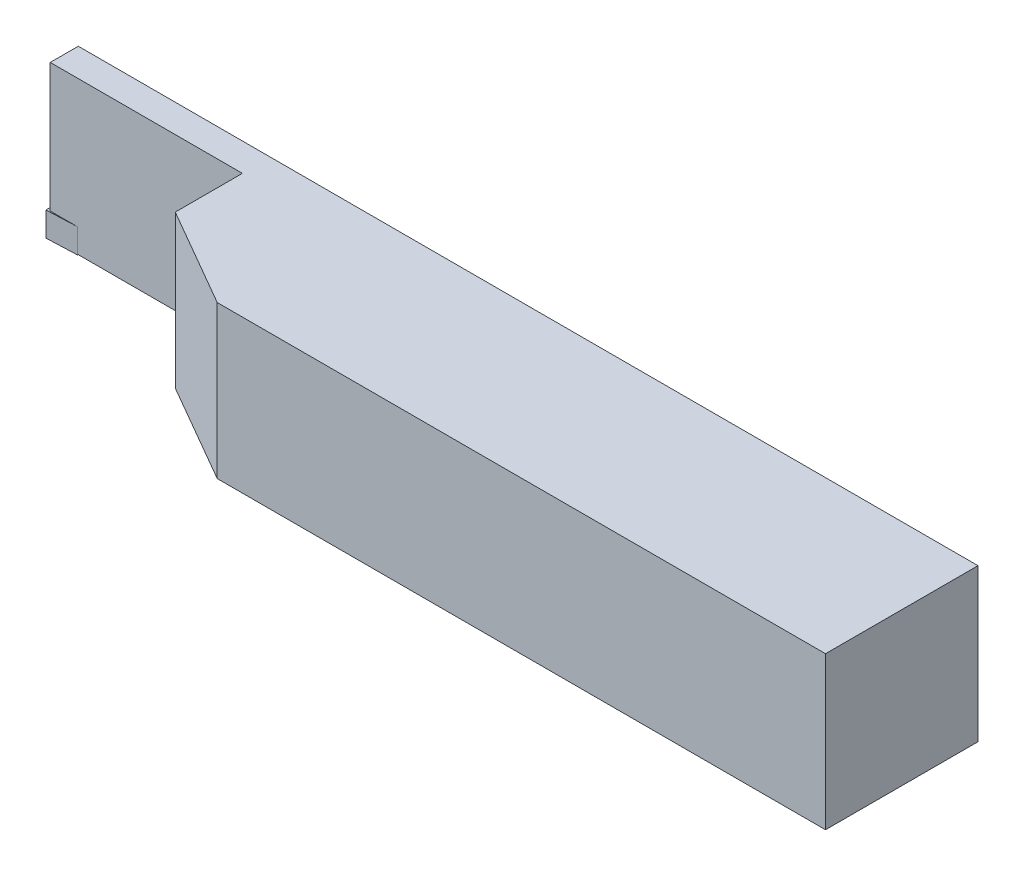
ISO-10303-21;
HEADER;
FILE_DESCRIPTION(('STEP AP214'),'2;1');
FILE_NAME('part.step','',(''),(''),'','','');
FILE_SCHEMA(('AUTOMOTIVE_DESIGN { 1 0 10303 214 1 1 1 1 }'));
ENDSEC;
DATA;
#1=APPLICATION_CONTEXT('core data for automotive mechanical design processes');
#2=APPLICATION_PROTOCOL_DEFINITION('international standard','automotive_design',2000,#1);
#3=PRODUCT_CONTEXT('',#1,'mechanical');
#4=PRODUCT('Part','Part','',(#3));
#5=PRODUCT_RELATED_PRODUCT_CATEGORY('part','',(#4));
#6=PRODUCT_DEFINITION_FORMATION('','',#4);
#7=PRODUCT_DEFINITION_CONTEXT('part definition',#1,'design');
#8=PRODUCT_DEFINITION('design','',#6,#7);
#9=PRODUCT_DEFINITION_SHAPE('','',#8);
#10=(LENGTH_UNIT() NAMED_UNIT(*) SI_UNIT(.MILLI.,.METRE.));
#11=(NAMED_UNIT(*) PLANE_ANGLE_UNIT() SI_UNIT($,.RADIAN.));
#12=(NAMED_UNIT(*) SI_UNIT($,.STERADIAN.) SOLID_ANGLE_UNIT());
#13=UNCERTAINTY_MEASURE_WITH_UNIT(LENGTH_MEASURE(1.E-05),#10,'distance_accuracy_value','');
#14=(GEOMETRIC_REPRESENTATION_CONTEXT(3) GLOBAL_UNCERTAINTY_ASSIGNED_CONTEXT((#13)) GLOBAL_UNIT_ASSIGNED_CONTEXT((#10,
#11,#12)) REPRESENTATION_CONTEXT('',''));
#15=CARTESIAN_POINT('',(0.,0.,0.));
#16=DIRECTION('',(0.,0.,1.));
#17=DIRECTION('',(1.,0.,0.));
#18=AXIS2_PLACEMENT_3D('',#15,#16,#17);
#19=CARTESIAN_POINT('',(4.99,4.,4.79039200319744));
#20=DIRECTION('',(0.,-1.,0.));
#21=DIRECTION('',(0.,0.,-1.));
#22=AXIS2_PLACEMENT_3D('',#19,#20,#21);
#23=CYLINDRICAL_SURFACE('',#22,0.0100000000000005);
#24=DIRECTION('',(0.,-1.,0.));
#25=VECTOR('',#24,1.);
#26=CARTESIAN_POINT('',(4.99277243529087,4.,4.8));
#27=LINE('',#26,#25);
#28=CARTESIAN_POINT('',(4.99277243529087,4.,4.8));
#29=VERTEX_POINT('',#28);
#30=CARTESIAN_POINT('',(4.99277243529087,0.0999999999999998,4.8));
#31=VERTEX_POINT('',#30);
#32=EDGE_CURVE('E134',#29,#31,#27,.T.);
#33=ORIENTED_EDGE('',*,*,#32,.F.);
#34=CARTESIAN_POINT('',(4.99,4.,4.79039200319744));
#35=DIRECTION('',(0.,1.,0.));
#36=DIRECTION('',(0.,0.,-1.));
#37=AXIS2_PLACEMENT_3D('',#34,#35,#36);
#38=CIRCLE('',#37,0.0100000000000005);
#39=CARTESIAN_POINT('',(4.99039968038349,4.,4.80038401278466));
#40=VERTEX_POINT('',#39);
#41=EDGE_CURVE('E113',#40,#29,#38,.T.);
#42=ORIENTED_EDGE('',*,*,#41,.F.);
#43=DIRECTION('',(0.,-1.,0.));
#44=VECTOR('',#43,1.);
#45=CARTESIAN_POINT('',(4.99039968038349,4.,4.80038401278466));
#46=LINE('',#45,#44);
#47=CARTESIAN_POINT('',(4.99039968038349,0.,4.80038401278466));
#48=VERTEX_POINT('',#47);
#49=EDGE_CURVE('E121',#40,#48,#46,.T.);
#50=ORIENTED_EDGE('',*,*,#49,.T.);
#51=CARTESIAN_POINT('',(4.99,0.,4.79039200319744));
#52=DIRECTION('',(0.,1.,0.));
#53=DIRECTION('',(0.,0.,-1.));
#54=AXIS2_PLACEMENT_3D('',#51,#52,#53);
#55=CIRCLE('',#54,0.0100000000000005);
#56=CARTESIAN_POINT('',(5.,0.,4.79039200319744));
#57=VERTEX_POINT('',#56);
#58=EDGE_CURVE('E151',#48,#57,#55,.T.);
#59=ORIENTED_EDGE('',*,*,#58,.T.);
#60=DIRECTION('',(0.,-1.,0.));
#61=VECTOR('',#60,1.);
#62=CARTESIAN_POINT('',(5.,4.,4.79039200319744));
#63=LINE('',#62,#61);
#64=CARTESIAN_POINT('',(5.,0.0999999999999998,4.79039200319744));
#65=VERTEX_POINT('',#64);
#66=EDGE_CURVE('E129',#65,#57,#63,.T.);
#67=ORIENTED_EDGE('',*,*,#66,.F.);
#68=CARTESIAN_POINT('',(4.99,0.0999999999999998,4.79039200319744));
#69=DIRECTION('',(0.,1.,0.));
#70=DIRECTION('',(0.,0.,1.));
#71=AXIS2_PLACEMENT_3D('',#68,#69,#70);
#72=CIRCLE('',#71,0.0100000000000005);
#73=EDGE_CURVE('E146',#31,#65,#72,.T.);
#74=ORIENTED_EDGE('',*,*,#73,.F.);
#75=EDGE_LOOP('',(#33,#42,#50,#59,#67,#74));
#76=FACE_BOUND('',#75,.T.);
#77=ADVANCED_FACE('F31',(#76),#23,.T.);
#78=CARTESIAN_POINT('',(5.,4.,0.209607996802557));
#79=DIRECTION('',(-1.,0.,0.));
#80=DIRECTION('',(0.,0.,1.));
#81=AXIS2_PLACEMENT_3D('',#78,#79,#80);
#82=PLANE('',#81);
#83=DIRECTION('',(0.,0.,-1.));
#84=VECTOR('',#83,1.);
#85=CARTESIAN_POINT('',(5.,0.0999999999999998,0.209607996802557));
#86=LINE('',#85,#84);
#87=CARTESIAN_POINT('',(5.,0.0999999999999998,0.209607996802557));
#88=VERTEX_POINT('',#87);
#89=EDGE_CURVE('E258',#65,#88,#86,.T.);
#90=ORIENTED_EDGE('',*,*,#89,.F.);
#91=ORIENTED_EDGE('',*,*,#66,.T.);
#92=DIRECTION('',(0.,0.,-1.));
#93=VECTOR('',#92,1.);
#94=CARTESIAN_POINT('',(5.,0.,0.209607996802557));
#95=LINE('',#94,#93);
#96=CARTESIAN_POINT('',(5.,0.,0.209607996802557));
#97=VERTEX_POINT('',#96);
#98=EDGE_CURVE('E153',#57,#97,#95,.T.);
#99=ORIENTED_EDGE('',*,*,#98,.T.);
#100=DIRECTION('',(0.,-1.,0.));
#101=VECTOR('',#100,1.);
#102=CARTESIAN_POINT('',(5.,4.,0.209607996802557));
#103=LINE('',#102,#101);
#104=EDGE_CURVE('E163',#88,#97,#103,.T.);
#105=ORIENTED_EDGE('',*,*,#104,.F.);
#106=EDGE_LOOP('',(#90,#91,#99,#105));
#107=FACE_BOUND('',#106,.T.);
#108=ADVANCED_FACE('F277',(#107),#82,.F.);
#109=CARTESIAN_POINT('',(4.99,4.,0.209607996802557));
#110=DIRECTION('',(0.,-1.,0.));
#111=DIRECTION('',(0.,0.,-1.));
#112=AXIS2_PLACEMENT_3D('',#109,#110,#111);
#113=CYLINDRICAL_SURFACE('',#112,0.0100000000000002);
#114=DIRECTION('',(0.,-1.,0.));
#115=VECTOR('',#114,1.);
#116=CARTESIAN_POINT('',(4.99277243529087,4.,0.199999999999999));
#117=LINE('',#116,#115);
#118=CARTESIAN_POINT('',(4.99277243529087,0.0999999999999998,0.199999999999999));
#119=VERTEX_POINT('',#118);
#120=CARTESIAN_POINT('',(4.99277243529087,4.,0.199999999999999));
#121=VERTEX_POINT('',#120);
#122=EDGE_CURVE('E46',#119,#121,#117,.F.);
#123=ORIENTED_EDGE('',*,*,#122,.F.);
#124=CARTESIAN_POINT('',(4.99,0.0999999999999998,0.209607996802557));
#125=DIRECTION('',(0.,1.,0.));
#126=DIRECTION('',(0.,0.,1.));
#127=AXIS2_PLACEMENT_3D('',#124,#125,#126);
#128=CIRCLE('',#127,0.0100000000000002);
#129=EDGE_CURVE('E11',#88,#119,#128,.T.);
#130=ORIENTED_EDGE('',*,*,#129,.F.);
#131=ORIENTED_EDGE('',*,*,#104,.T.);
#132=CARTESIAN_POINT('',(4.99,0.,0.209607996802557));
#133=DIRECTION('',(0.,1.,0.));
#134=DIRECTION('',(0.,0.,-1.));
#135=AXIS2_PLACEMENT_3D('',#132,#133,#134);
#136=CIRCLE('',#135,0.0100000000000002);
#137=CARTESIAN_POINT('',(4.99039968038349,0.,0.19961598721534));
#138=VERTEX_POINT('',#137);
#139=EDGE_CURVE('E156',#97,#138,#136,.T.);
#140=ORIENTED_EDGE('',*,*,#139,.T.);
#141=DIRECTION('',(0.,-1.,0.));
#142=VECTOR('',#141,1.);
#143=CARTESIAN_POINT('',(4.99039968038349,4.,0.19961598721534));
#144=LINE('',#143,#142);
#145=CARTESIAN_POINT('',(4.99039968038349,4.,0.19961598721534));
#146=VERTEX_POINT('',#145);
#147=EDGE_CURVE('E161',#146,#138,#144,.T.);
#148=ORIENTED_EDGE('',*,*,#147,.F.);
#149=CARTESIAN_POINT('',(4.99,4.,0.209607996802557));
#150=DIRECTION('',(0.,1.,0.));
#151=DIRECTION('',(0.,0.,-1.));
#152=AXIS2_PLACEMENT_3D('',#149,#150,#151);
#153=CIRCLE('',#152,0.0100000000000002);
#154=EDGE_CURVE('E135',#121,#146,#153,.T.);
#155=ORIENTED_EDGE('',*,*,#154,.F.);
#156=EDGE_LOOP('',(#123,#130,#131,#140,#148,#155));
#157=FACE_BOUND('',#156,.T.);
#158=ADVANCED_FACE('F284',(#157),#113,.T.);
#159=CARTESIAN_POINT('',(0.00999999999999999,4.,0.0104079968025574));
#160=DIRECTION('',(0.,1.,0.));
#161=DIRECTION('',(0.,0.,1.));
#162=AXIS2_PLACEMENT_3D('',#159,#160,#161);
#163=PLANE('',#162);
#164=ORIENTED_EDGE('',*,*,#41,.T.);
#165=DIRECTION('',(-1.,0.,0.));
#166=VECTOR('',#165,1.);
#167=CARTESIAN_POINT('',(0.0100000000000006,4.,4.8));
#168=LINE('',#167,#166);
#169=CARTESIAN_POINT('',(0.5,4.,4.8));
#170=VERTEX_POINT('',#169);
#171=EDGE_CURVE('E39',#29,#170,#168,.T.);
#172=ORIENTED_EDGE('',*,*,#171,.T.);
#173=DIRECTION('',(0.,0.,-1.));
#174=VECTOR('',#173,1.);
#175=CARTESIAN_POINT('',(0.5,4.,0.0104079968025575));
#176=LINE('',#175,#174);
#177=CARTESIAN_POINT('',(0.5,4.,0.2));
#178=VERTEX_POINT('',#177);
#179=EDGE_CURVE('E174',#170,#178,#176,.T.);
#180=ORIENTED_EDGE('',*,*,#179,.T.);
#181=DIRECTION('',(1.,0.,0.));
#182=VECTOR('',#181,1.);
#183=CARTESIAN_POINT('',(0.01,4.,0.2));
#184=LINE('',#183,#182);
#185=EDGE_CURVE('E172',#178,#121,#184,.T.);
#186=ORIENTED_EDGE('',*,*,#185,.T.);
#187=ORIENTED_EDGE('',*,*,#154,.T.);
#188=DIRECTION('',(-0.999200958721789,0.,-0.0399680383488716));
#189=VECTOR('',#188,1.);
#190=CARTESIAN_POINT('',(0.0103996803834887,4.,0.000415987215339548));
#191=LINE('',#190,#189);
#192=CARTESIAN_POINT('',(0.0103996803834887,4.,0.000415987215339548));
#193=VERTEX_POINT('',#192);
#194=EDGE_CURVE('E55',#146,#193,#191,.T.);
#195=ORIENTED_EDGE('',*,*,#194,.T.);
#196=CARTESIAN_POINT('',(0.00999999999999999,4.,0.0104079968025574));
#197=DIRECTION('',(0.,1.,0.));
#198=DIRECTION('',(0.,0.,1.));
#199=AXIS2_PLACEMENT_3D('',#196,#197,#198);
#200=CIRCLE('',#199,0.00999999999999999);
#201=CARTESIAN_POINT('',(0.,4.,0.0104079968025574));
#202=VERTEX_POINT('',#201);
#203=EDGE_CURVE('E159',#193,#202,#200,.T.);
#204=ORIENTED_EDGE('',*,*,#203,.T.);
#205=DIRECTION('',(0.,0.,1.));
#206=VECTOR('',#205,1.);
#207=CARTESIAN_POINT('',(0.,4.,0.0104079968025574));
#208=LINE('',#207,#206);
#209=CARTESIAN_POINT('',(0.,4.,4.98959200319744));
#210=VERTEX_POINT('',#209);
#211=EDGE_CURVE('E97',#202,#210,#208,.T.);
#212=ORIENTED_EDGE('',*,*,#211,.T.);
#213=CARTESIAN_POINT('',(0.0100000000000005,4.,4.98959200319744));
#214=DIRECTION('',(0.,1.,0.));
#215=DIRECTION('',(0.,0.,-1.));
#216=AXIS2_PLACEMENT_3D('',#213,#214,#215);
#217=CIRCLE('',#216,0.00999999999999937);
#218=CARTESIAN_POINT('',(0.0103996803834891,4.,4.99958401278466));
#219=VERTEX_POINT('',#218);
#220=EDGE_CURVE('E115',#210,#219,#217,.T.);
#221=ORIENTED_EDGE('',*,*,#220,.T.);
#222=DIRECTION('',(0.999200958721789,0.,-0.0399680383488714));
#223=VECTOR('',#222,1.);
#224=CARTESIAN_POINT('',(4.99039968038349,4.,4.80038401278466));
#225=LINE('',#224,#223);
#226=EDGE_CURVE('E107',#219,#40,#225,.T.);
#227=ORIENTED_EDGE('',*,*,#226,.T.);
#228=EDGE_LOOP('',(#164,#172,#180,#186,#187,#195,#204,#212,#221,#227));
#229=FACE_BOUND('',#228,.T.);
#230=ADVANCED_FACE('F109',(#229),#163,.T.);
#231=CARTESIAN_POINT('',(0.00999999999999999,4.,0.0104079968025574));
#232=DIRECTION('',(0.,-1.,0.));
#233=DIRECTION('',(0.,0.,-1.));
#234=AXIS2_PLACEMENT_3D('',#231,#232,#233);
#235=CYLINDRICAL_SURFACE('',#234,0.00999999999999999);
#236=CARTESIAN_POINT('',(0.00999999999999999,0.,0.0104079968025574));
#237=DIRECTION('',(0.,1.,0.));
#238=DIRECTION('',(0.,0.,1.));
#239=AXIS2_PLACEMENT_3D('',#236,#237,#238);
#240=CIRCLE('',#239,0.00999999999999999);
#241=CARTESIAN_POINT('',(0.0103996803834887,0.,0.000415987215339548));
#242=VERTEX_POINT('',#241);
#243=CARTESIAN_POINT('',(0.,0.,0.0104079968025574));
#244=VERTEX_POINT('',#243);
#245=EDGE_CURVE('E142',#242,#244,#240,.T.);
#246=ORIENTED_EDGE('',*,*,#245,.T.);
#247=DIRECTION('',(0.,-1.,0.));
#248=VECTOR('',#247,1.);
#249=CARTESIAN_POINT('',(0.,4.,0.0104079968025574));
#250=LINE('',#249,#248);
#251=EDGE_CURVE('E170',#202,#244,#250,.T.);
#252=ORIENTED_EDGE('',*,*,#251,.F.);
#253=ORIENTED_EDGE('',*,*,#203,.F.);
#254=DIRECTION('',(0.,-1.,0.));
#255=VECTOR('',#254,1.);
#256=CARTESIAN_POINT('',(0.0103996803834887,4.,0.000415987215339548));
#257=LINE('',#256,#255);
#258=EDGE_CURVE('E141',#193,#242,#257,.T.);
#259=ORIENTED_EDGE('',*,*,#258,.T.);
#260=EDGE_LOOP('',(#246,#252,#253,#259));
#261=FACE_BOUND('',#260,.T.);
#262=ADVANCED_FACE('F33',(#261),#235,.T.);
#263=CARTESIAN_POINT('',(0.,4.,0.0104079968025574));
#264=DIRECTION('',(1.,0.,0.));
#265=DIRECTION('',(0.,0.,-1.));
#266=AXIS2_PLACEMENT_3D('',#263,#264,#265);
#267=PLANE('',#266);
#268=DIRECTION('',(0.,0.,1.));
#269=VECTOR('',#268,1.);
#270=CARTESIAN_POINT('',(0.,0.,0.0104079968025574));
#271=LINE('',#270,#269);
#272=CARTESIAN_POINT('',(0.,0.,4.98959200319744));
#273=VERTEX_POINT('',#272);
#274=EDGE_CURVE('E145',#244,#273,#271,.T.);
#275=ORIENTED_EDGE('',*,*,#274,.T.);
#276=DIRECTION('',(0.,-1.,0.));
#277=VECTOR('',#276,1.);
#278=CARTESIAN_POINT('',(0.,4.,4.98959200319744));
#279=LINE('',#278,#277);
#280=EDGE_CURVE('E167',#210,#273,#279,.T.);
#281=ORIENTED_EDGE('',*,*,#280,.F.);
#282=ORIENTED_EDGE('',*,*,#211,.F.);
#283=ORIENTED_EDGE('',*,*,#251,.T.);
#284=EDGE_LOOP('',(#275,#281,#282,#283));
#285=FACE_BOUND('',#284,.T.);
#286=ADVANCED_FACE('F265',(#285),#267,.F.);
#287=CARTESIAN_POINT('',(0.0100000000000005,4.,4.98959200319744));
#288=DIRECTION('',(0.,-1.,0.));
#289=DIRECTION('',(0.,0.,-1.));
#290=AXIS2_PLACEMENT_3D('',#287,#288,#289);
#291=CYLINDRICAL_SURFACE('',#290,0.00999999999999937);
#292=CARTESIAN_POINT('',(0.0100000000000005,0.,4.98959200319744));
#293=DIRECTION('',(0.,1.,0.));
#294=DIRECTION('',(0.,0.,-1.));
#295=AXIS2_PLACEMENT_3D('',#292,#293,#294);
#296=CIRCLE('',#295,0.00999999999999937);
#297=CARTESIAN_POINT('',(0.0103996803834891,0.,4.99958401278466));
#298=VERTEX_POINT('',#297);
#299=EDGE_CURVE('E148',#273,#298,#296,.T.);
#300=ORIENTED_EDGE('',*,*,#299,.T.);
#301=DIRECTION('',(0.,-1.,0.));
#302=VECTOR('',#301,1.);
#303=CARTESIAN_POINT('',(0.0103996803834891,4.,4.99958401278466));
#304=LINE('',#303,#302);
#305=EDGE_CURVE('E128',#219,#298,#304,.T.);
#306=ORIENTED_EDGE('',*,*,#305,.F.);
#307=ORIENTED_EDGE('',*,*,#220,.F.);
#308=ORIENTED_EDGE('',*,*,#280,.T.);
#309=EDGE_LOOP('',(#300,#306,#307,#308));
#310=FACE_BOUND('',#309,.T.);
#311=ADVANCED_FACE('F268',(#310),#291,.T.);
#312=CARTESIAN_POINT('',(4.99039968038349,4.,4.80038401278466));
#313=DIRECTION('',(-0.0399680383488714,0.,-0.999200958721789));
#314=DIRECTION('',(-0.999200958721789,0.,0.0399680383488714));
#315=AXIS2_PLACEMENT_3D('',#312,#313,#314);
#316=PLANE('',#315);
#317=DIRECTION('',(0.999200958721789,0.,-0.0399680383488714));
#318=VECTOR('',#317,1.);
#319=CARTESIAN_POINT('',(4.99039968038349,0.,4.80038401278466));
#320=LINE('',#319,#318);
#321=EDGE_CURVE('E124',#298,#48,#320,.T.);
#322=ORIENTED_EDGE('',*,*,#321,.T.);
#323=ORIENTED_EDGE('',*,*,#49,.F.);
#324=ORIENTED_EDGE('',*,*,#226,.F.);
#325=ORIENTED_EDGE('',*,*,#305,.T.);
#326=EDGE_LOOP('',(#322,#323,#324,#325));
#327=FACE_BOUND('',#326,.T.);
#328=ADVANCED_FACE('F122',(#327),#316,.F.);
#329=CARTESIAN_POINT('',(0.0103996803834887,4.,0.000415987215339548));
#330=DIRECTION('',(-0.0399680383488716,0.,0.999200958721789));
#331=DIRECTION('',(0.999200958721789,0.,0.0399680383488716));
#332=AXIS2_PLACEMENT_3D('',#329,#330,#331);
#333=PLANE('',#332);
#334=DIRECTION('',(-0.999200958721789,0.,-0.0399680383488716));
#335=VECTOR('',#334,1.);
#336=CARTESIAN_POINT('',(0.0103996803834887,0.,0.000415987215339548));
#337=LINE('',#336,#335);
#338=EDGE_CURVE('E88',#138,#242,#337,.T.);
#339=ORIENTED_EDGE('',*,*,#338,.T.);
#340=ORIENTED_EDGE('',*,*,#258,.F.);
#341=ORIENTED_EDGE('',*,*,#194,.F.);
#342=ORIENTED_EDGE('',*,*,#147,.T.);
#343=EDGE_LOOP('',(#339,#340,#341,#342));
#344=FACE_BOUND('',#343,.T.);
#345=ADVANCED_FACE('F356',(#344),#333,.F.);
#346=CARTESIAN_POINT('',(0.00999999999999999,0.,0.0104079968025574));
#347=DIRECTION('',(0.,1.,0.));
#348=DIRECTION('',(0.,0.,1.));
#349=AXIS2_PLACEMENT_3D('',#346,#347,#348);
#350=PLANE('',#349);
#351=ORIENTED_EDGE('',*,*,#245,.F.);
#352=ORIENTED_EDGE('',*,*,#338,.F.);
#353=ORIENTED_EDGE('',*,*,#139,.F.);
#354=ORIENTED_EDGE('',*,*,#98,.F.);
#355=ORIENTED_EDGE('',*,*,#58,.F.);
#356=ORIENTED_EDGE('',*,*,#321,.F.);
#357=ORIENTED_EDGE('',*,*,#299,.F.);
#358=ORIENTED_EDGE('',*,*,#274,.F.);
#359=EDGE_LOOP('',(#351,#352,#353,#354,#355,#356,#357,#358));
#360=FACE_BOUND('',#359,.T.);
#361=ADVANCED_FACE('F271',(#360),#350,.F.);
#362=CARTESIAN_POINT('',(0.5,0.1,25.2));
#363=DIRECTION('',(0.,1.,0.));
#364=DIRECTION('',(0.,0.,1.));
#365=AXIS2_PLACEMENT_3D('',#362,#363,#364);
#366=PLANE('',#365);
#367=DIRECTION('',(1.,0.,0.));
#368=VECTOR('',#367,1.);
#369=CARTESIAN_POINT('',(0.5,0.1,4.8));
#370=LINE('',#369,#368);
#371=CARTESIAN_POINT('',(32.,0.1,4.8));
#372=VERTEX_POINT('',#371);
#373=EDGE_CURVE('E321',#31,#372,#370,.T.);
#374=ORIENTED_EDGE('',*,*,#373,.F.);
#375=ORIENTED_EDGE('',*,*,#73,.T.);
#376=ORIENTED_EDGE('',*,*,#89,.T.);
#377=ORIENTED_EDGE('',*,*,#129,.T.);
#378=DIRECTION('',(-1.,0.,0.));
#379=VECTOR('',#378,1.);
#380=CARTESIAN_POINT('',(0.5,0.1,0.2));
#381=LINE('',#380,#379);
#382=CARTESIAN_POINT('',(148.,0.1,0.199999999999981));
#383=VERTEX_POINT('',#382);
#384=EDGE_CURVE('E248',#383,#119,#381,.T.);
#385=ORIENTED_EDGE('',*,*,#384,.F.);
#386=DIRECTION('',(0.,0.,-1.));
#387=VECTOR('',#386,1.);
#388=CARTESIAN_POINT('',(148.,0.1,25.2));
#389=LINE('',#388,#387);
#390=CARTESIAN_POINT('',(148.,0.1,25.2));
#391=VERTEX_POINT('',#390);
#392=EDGE_CURVE('E319',#391,#383,#389,.T.);
#393=ORIENTED_EDGE('',*,*,#392,.F.);
#394=DIRECTION('',(1.,0.,0.));
#395=VECTOR('',#394,1.);
#396=CARTESIAN_POINT('',(48.2812775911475,0.1,25.2));
#397=LINE('',#396,#395);
#398=CARTESIAN_POINT('',(48.2812775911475,0.1,25.2));
#399=VERTEX_POINT('',#398);
#400=EDGE_CURVE('E317',#399,#391,#397,.T.);
#401=ORIENTED_EDGE('',*,*,#400,.F.);
#402=DIRECTION('',(0.86602540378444,0.,0.499999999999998));
#403=VECTOR('',#402,1.);
#404=CARTESIAN_POINT('',(32.,0.1,15.8));
#405=LINE('',#404,#403);
#406=CARTESIAN_POINT('',(32.,0.1,15.8));
#407=VERTEX_POINT('',#406);
#408=EDGE_CURVE('E310',#407,#399,#405,.T.);
#409=ORIENTED_EDGE('',*,*,#408,.F.);
#410=DIRECTION('',(0.,0.,1.));
#411=VECTOR('',#410,1.);
#412=CARTESIAN_POINT('',(32.,0.1,4.8));
#413=LINE('',#412,#411);
#414=EDGE_CURVE('E315',#372,#407,#413,.T.);
#415=ORIENTED_EDGE('',*,*,#414,.F.);
#416=EDGE_LOOP('',(#374,#375,#376,#377,#385,#393,#401,#409,#415));
#417=FACE_BOUND('',#416,.T.);
#418=ADVANCED_FACE('F281',(#417),#366,.F.);
#419=CARTESIAN_POINT('',(0.5,25.1,4.8));
#420=DIRECTION('',(0.,0.,-1.));
#421=DIRECTION('',(-1.,0.,0.));
#422=AXIS2_PLACEMENT_3D('',#419,#420,#421);
#423=PLANE('',#422);
#424=ORIENTED_EDGE('',*,*,#171,.F.);
#425=ORIENTED_EDGE('',*,*,#32,.T.);
#426=ORIENTED_EDGE('',*,*,#373,.T.);
#427=DIRECTION('',(0.,-1.,0.));
#428=VECTOR('',#427,1.);
#429=CARTESIAN_POINT('',(32.,25.1,4.8));
#430=LINE('',#429,#428);
#431=CARTESIAN_POINT('',(32.,25.1,4.8));
#432=VERTEX_POINT('',#431);
#433=EDGE_CURVE('E235',#432,#372,#430,.T.);
#434=ORIENTED_EDGE('',*,*,#433,.F.);
#435=DIRECTION('',(1.,0.,0.));
#436=VECTOR('',#435,1.);
#437=CARTESIAN_POINT('',(0.5,25.1,4.8));
#438=LINE('',#437,#436);
#439=CARTESIAN_POINT('',(0.5,25.1,4.8));
#440=VERTEX_POINT('',#439);
#441=EDGE_CURVE('E232',#440,#432,#438,.T.);
#442=ORIENTED_EDGE('',*,*,#441,.F.);
#443=DIRECTION('',(0.,-1.,0.));
#444=VECTOR('',#443,1.);
#445=CARTESIAN_POINT('',(0.5,25.1,4.8));
#446=LINE('',#445,#444);
#447=EDGE_CURVE('E189',#440,#170,#446,.T.);
#448=ORIENTED_EDGE('',*,*,#447,.T.);
#449=EDGE_LOOP('',(#424,#425,#426,#434,#442,#448));
#450=FACE_BOUND('',#449,.T.);
#451=ADVANCED_FACE('F184',(#450),#423,.F.);
#452=CARTESIAN_POINT('',(0.5,25.1,0.2));
#453=DIRECTION('',(0.,0.,1.));
#454=DIRECTION('',(1.,0.,0.));
#455=AXIS2_PLACEMENT_3D('',#452,#453,#454);
#456=PLANE('',#455);
#457=ORIENTED_EDGE('',*,*,#384,.T.);
#458=ORIENTED_EDGE('',*,*,#122,.T.);
#459=ORIENTED_EDGE('',*,*,#185,.F.);
#460=DIRECTION('',(0.,-1.,0.));
#461=VECTOR('',#460,1.);
#462=CARTESIAN_POINT('',(0.5,25.1,0.2));
#463=LINE('',#462,#461);
#464=CARTESIAN_POINT('',(0.5,25.1,0.2));
#465=VERTEX_POINT('',#464);
#466=EDGE_CURVE('E288',#465,#178,#463,.T.);
#467=ORIENTED_EDGE('',*,*,#466,.F.);
#468=DIRECTION('',(-1.,0.,0.));
#469=VECTOR('',#468,1.);
#470=CARTESIAN_POINT('',(0.5,25.1,0.2));
#471=LINE('',#470,#469);
#472=CARTESIAN_POINT('',(148.,25.1,0.199999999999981));
#473=VERTEX_POINT('',#472);
#474=EDGE_CURVE('E244',#473,#465,#471,.T.);
#475=ORIENTED_EDGE('',*,*,#474,.F.);
#476=DIRECTION('',(0.,-1.,0.));
#477=VECTOR('',#476,1.);
#478=CARTESIAN_POINT('',(148.,25.1,0.199999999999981));
#479=LINE('',#478,#477);
#480=EDGE_CURVE('E289',#473,#383,#479,.T.);
#481=ORIENTED_EDGE('',*,*,#480,.T.);
#482=EDGE_LOOP('',(#457,#458,#459,#467,#475,#481));
#483=FACE_BOUND('',#482,.T.);
#484=ADVANCED_FACE('F287',(#483),#456,.F.);
#485=CARTESIAN_POINT('',(0.5,25.1,0.2));
#486=DIRECTION('',(1.,0.,0.));
#487=DIRECTION('',(0.,0.,-1.));
#488=AXIS2_PLACEMENT_3D('',#485,#486,#487);
#489=PLANE('',#488);
#490=ORIENTED_EDGE('',*,*,#179,.F.);
#491=ORIENTED_EDGE('',*,*,#447,.F.);
#492=DIRECTION('',(0.,0.,1.));
#493=VECTOR('',#492,1.);
#494=CARTESIAN_POINT('',(0.5,25.1,0.2));
#495=LINE('',#494,#493);
#496=EDGE_CURVE('E239',#465,#440,#495,.T.);
#497=ORIENTED_EDGE('',*,*,#496,.F.);
#498=ORIENTED_EDGE('',*,*,#466,.T.);
#499=EDGE_LOOP('',(#490,#491,#497,#498));
#500=FACE_BOUND('',#499,.T.);
#501=ADVANCED_FACE('F250',(#500),#489,.F.);
#502=CARTESIAN_POINT('',(32.,25.1,4.8));
#503=DIRECTION('',(1.,0.,0.));
#504=DIRECTION('',(0.,0.,-1.));
#505=AXIS2_PLACEMENT_3D('',#502,#503,#504);
#506=PLANE('',#505);
#507=ORIENTED_EDGE('',*,*,#414,.T.);
#508=DIRECTION('',(0.,-1.,0.));
#509=VECTOR('',#508,1.);
#510=CARTESIAN_POINT('',(32.,25.1,15.8));
#511=LINE('',#510,#509);
#512=CARTESIAN_POINT('',(32.,25.1,15.8));
#513=VERTEX_POINT('',#512);
#514=EDGE_CURVE('E253',#513,#407,#511,.T.);
#515=ORIENTED_EDGE('',*,*,#514,.F.);
#516=DIRECTION('',(0.,0.,1.));
#517=VECTOR('',#516,1.);
#518=CARTESIAN_POINT('',(32.,25.1,4.8));
#519=LINE('',#518,#517);
#520=EDGE_CURVE('E238',#432,#513,#519,.T.);
#521=ORIENTED_EDGE('',*,*,#520,.F.);
#522=ORIENTED_EDGE('',*,*,#433,.T.);
#523=EDGE_LOOP('',(#507,#515,#521,#522));
#524=FACE_BOUND('',#523,.T.);
#525=ADVANCED_FACE('F333',(#524),#506,.F.);
#526=CARTESIAN_POINT('',(32.,25.1,15.8));
#527=DIRECTION('',(0.499999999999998,0.,-0.86602540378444));
#528=DIRECTION('',(-0.86602540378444,0.,-0.499999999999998));
#529=AXIS2_PLACEMENT_3D('',#526,#527,#528);
#530=PLANE('',#529);
#531=ORIENTED_EDGE('',*,*,#408,.T.);
#532=DIRECTION('',(0.,-1.,0.));
#533=VECTOR('',#532,1.);
#534=CARTESIAN_POINT('',(48.2812775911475,25.1,25.2));
#535=LINE('',#534,#533);
#536=CARTESIAN_POINT('',(48.2812775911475,25.1,25.2));
#537=VERTEX_POINT('',#536);
#538=EDGE_CURVE('E301',#537,#399,#535,.T.);
#539=ORIENTED_EDGE('',*,*,#538,.F.);
#540=DIRECTION('',(0.86602540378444,0.,0.499999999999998));
#541=VECTOR('',#540,1.);
#542=CARTESIAN_POINT('',(32.,25.1,15.8));
#543=LINE('',#542,#541);
#544=EDGE_CURVE('E311',#513,#537,#543,.T.);
#545=ORIENTED_EDGE('',*,*,#544,.F.);
#546=ORIENTED_EDGE('',*,*,#514,.T.);
#547=EDGE_LOOP('',(#531,#539,#545,#546));
#548=FACE_BOUND('',#547,.T.);
#549=ADVANCED_FACE('F308',(#548),#530,.F.);
#550=CARTESIAN_POINT('',(48.2812775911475,25.1,25.2));
#551=DIRECTION('',(0.,0.,-1.));
#552=DIRECTION('',(-1.,0.,0.));
#553=AXIS2_PLACEMENT_3D('',#550,#551,#552);
#554=PLANE('',#553);
#555=ORIENTED_EDGE('',*,*,#400,.T.);
#556=DIRECTION('',(0.,-1.,0.));
#557=VECTOR('',#556,1.);
#558=CARTESIAN_POINT('',(148.,25.1,25.2));
#559=LINE('',#558,#557);
#560=CARTESIAN_POINT('',(148.,25.1,25.2));
#561=VERTEX_POINT('',#560);
#562=EDGE_CURVE('E292',#561,#391,#559,.T.);
#563=ORIENTED_EDGE('',*,*,#562,.F.);
#564=DIRECTION('',(1.,0.,0.));
#565=VECTOR('',#564,1.);
#566=CARTESIAN_POINT('',(48.2812775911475,25.1,25.2));
#567=LINE('',#566,#565);
#568=EDGE_CURVE('E329',#537,#561,#567,.T.);
#569=ORIENTED_EDGE('',*,*,#568,.F.);
#570=ORIENTED_EDGE('',*,*,#538,.T.);
#571=EDGE_LOOP('',(#555,#563,#569,#570));
#572=FACE_BOUND('',#571,.T.);
#573=ADVANCED_FACE('F337',(#572),#554,.F.);
#574=CARTESIAN_POINT('',(148.,25.1,25.2));
#575=DIRECTION('',(-1.,0.,0.));
#576=DIRECTION('',(0.,0.,1.));
#577=AXIS2_PLACEMENT_3D('',#574,#575,#576);
#578=PLANE('',#577);
#579=ORIENTED_EDGE('',*,*,#392,.T.);
#580=ORIENTED_EDGE('',*,*,#480,.F.);
#581=DIRECTION('',(0.,0.,-1.));
#582=VECTOR('',#581,1.);
#583=CARTESIAN_POINT('',(148.,25.1,25.2));
#584=LINE('',#583,#582);
#585=EDGE_CURVE('E294',#561,#473,#584,.T.);
#586=ORIENTED_EDGE('',*,*,#585,.F.);
#587=ORIENTED_EDGE('',*,*,#562,.T.);
#588=EDGE_LOOP('',(#579,#580,#586,#587));
#589=FACE_BOUND('',#588,.T.);
#590=ADVANCED_FACE('F327',(#589),#578,.F.);
#591=CARTESIAN_POINT('',(0.5,25.1,25.2));
#592=DIRECTION('',(0.,1.,0.));
#593=DIRECTION('',(0.,0.,1.));
#594=AXIS2_PLACEMENT_3D('',#591,#592,#593);
#595=PLANE('',#594);
#596=ORIENTED_EDGE('',*,*,#496,.T.);
#597=ORIENTED_EDGE('',*,*,#441,.T.);
#598=ORIENTED_EDGE('',*,*,#520,.T.);
#599=ORIENTED_EDGE('',*,*,#544,.T.);
#600=ORIENTED_EDGE('',*,*,#568,.T.);
#601=ORIENTED_EDGE('',*,*,#585,.T.);
#602=ORIENTED_EDGE('',*,*,#474,.T.);
#603=EDGE_LOOP('',(#596,#597,#598,#599,#600,#601,#602));
#604=FACE_BOUND('',#603,.T.);
#605=ADVANCED_FACE('F242',(#604),#595,.T.);
#606=CLOSED_SHELL('',(#77,#108,#158,#230,#262,#286,#311,#328,#345,#361,#418,#451,#484,#501,#525,
#549,#573,#590,#605));
#607=MANIFOLD_SOLID_BREP('B2',#606);
#608=ADVANCED_BREP_SHAPE_REPRESENTATION('',(#18,#607),#14);
#609=SHAPE_DEFINITION_REPRESENTATION(#9,#608);
ENDSEC;
END-ISO-10303-21;
